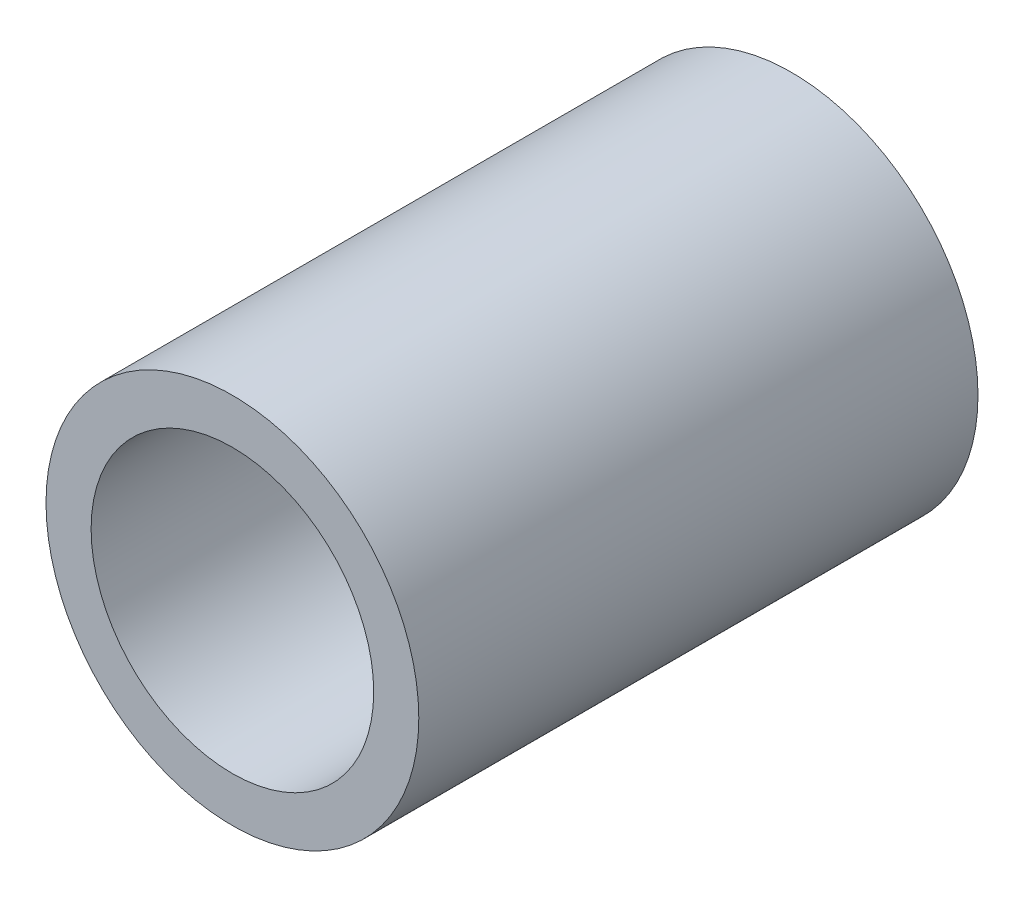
ISO-10303-21;
HEADER;
FILE_DESCRIPTION(('STEP AP214'),'2;1');
FILE_NAME('part.step','',(''),(''),'','','');
FILE_SCHEMA(('AUTOMOTIVE_DESIGN { 1 0 10303 214 1 1 1 1 }'));
ENDSEC;
DATA;
#1=APPLICATION_CONTEXT('core data for automotive mechanical design processes');
#2=APPLICATION_PROTOCOL_DEFINITION('international standard','automotive_design',2000,#1);
#3=PRODUCT_CONTEXT('',#1,'mechanical');
#4=PRODUCT('Part','Part','',(#3));
#5=PRODUCT_RELATED_PRODUCT_CATEGORY('part','',(#4));
#6=PRODUCT_DEFINITION_FORMATION('','',#4);
#7=PRODUCT_DEFINITION_CONTEXT('part definition',#1,'design');
#8=PRODUCT_DEFINITION('design','',#6,#7);
#9=PRODUCT_DEFINITION_SHAPE('','',#8);
#10=(LENGTH_UNIT() NAMED_UNIT(*) SI_UNIT(.MILLI.,.METRE.));
#11=(NAMED_UNIT(*) PLANE_ANGLE_UNIT() SI_UNIT($,.RADIAN.));
#12=(NAMED_UNIT(*) SI_UNIT($,.STERADIAN.) SOLID_ANGLE_UNIT());
#13=UNCERTAINTY_MEASURE_WITH_UNIT(LENGTH_MEASURE(1.E-05),#10,'distance_accuracy_value','');
#14=(GEOMETRIC_REPRESENTATION_CONTEXT(3) GLOBAL_UNCERTAINTY_ASSIGNED_CONTEXT((#13)) GLOBAL_UNIT_ASSIGNED_CONTEXT((#10,
#11,#12)) REPRESENTATION_CONTEXT('',''));
#15=CARTESIAN_POINT('',(0.,0.,0.));
#16=DIRECTION('',(0.,0.,1.));
#17=DIRECTION('',(1.,0.,0.));
#18=AXIS2_PLACEMENT_3D('',#15,#16,#17);
#19=CARTESIAN_POINT('',(0.,0.,9.52500000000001));
#20=DIRECTION('',(0.,0.,1.));
#21=DIRECTION('',(1.,0.,0.));
#22=AXIS2_PLACEMENT_3D('',#19,#20,#21);
#23=PLANE('',#22);
#24=CARTESIAN_POINT('',(0.,0.,9.52500000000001));
#25=DIRECTION('',(0.,0.,1.));
#26=DIRECTION('',(1.,0.,0.));
#27=AXIS2_PLACEMENT_3D('',#24,#25,#26);
#28=CIRCLE('',#27,6.35);
#29=CARTESIAN_POINT('',(-6.3500000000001,0.,9.52499999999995));
#30=VERTEX_POINT('',#29);
#31=EDGE_CURVE('E10',#30,#30,#28,.T.);
#32=ORIENTED_EDGE('',*,*,#31,.T.);
#33=EDGE_LOOP('',(#32));
#34=FACE_BOUND('',#33,.T.);
#35=CARTESIAN_POINT('',(0.,0.,9.52500000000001));
#36=DIRECTION('',(0.,0.,1.));
#37=DIRECTION('',(1.,0.,0.));
#38=AXIS2_PLACEMENT_3D('',#35,#36,#37);
#39=CIRCLE('',#38,4.8133);
#40=CARTESIAN_POINT('',(-4.8133000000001,0.,9.52499999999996));
#41=VERTEX_POINT('',#40);
#42=EDGE_CURVE('E39',#41,#41,#39,.T.);
#43=ORIENTED_EDGE('',*,*,#42,.F.);
#44=EDGE_LOOP('',(#43));
#45=FACE_BOUND('',#44,.T.);
#46=ADVANCED_FACE('F28',(#34,#45),#23,.T.);
#47=CARTESIAN_POINT('',(0.,0.,-9.52500000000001));
#48=DIRECTION('',(0.,0.,1.));
#49=DIRECTION('',(1.,0.,0.));
#50=AXIS2_PLACEMENT_3D('',#47,#48,#49);
#51=PLANE('',#50);
#52=CARTESIAN_POINT('',(0.,0.,-9.52500000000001));
#53=DIRECTION('',(0.,0.,1.));
#54=DIRECTION('',(1.,0.,0.));
#55=AXIS2_PLACEMENT_3D('',#52,#53,#54);
#56=CIRCLE('',#55,6.35);
#57=CARTESIAN_POINT('',(-6.34999999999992,0.,-9.52500000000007));
#58=VERTEX_POINT('',#57);
#59=EDGE_CURVE('E32',#58,#58,#56,.T.);
#60=ORIENTED_EDGE('',*,*,#59,.F.);
#61=EDGE_LOOP('',(#60));
#62=FACE_BOUND('',#61,.T.);
#63=CARTESIAN_POINT('',(0.,0.,-9.52500000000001));
#64=DIRECTION('',(0.,0.,1.));
#65=DIRECTION('',(1.,0.,0.));
#66=AXIS2_PLACEMENT_3D('',#63,#64,#65);
#67=CIRCLE('',#66,4.8133);
#68=CARTESIAN_POINT('',(-4.81329999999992,0.,-9.52500000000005));
#69=VERTEX_POINT('',#68);
#70=EDGE_CURVE('E41',#69,#69,#67,.T.);
#71=ORIENTED_EDGE('',*,*,#70,.T.);
#72=EDGE_LOOP('',(#71));
#73=FACE_BOUND('',#72,.T.);
#74=ADVANCED_FACE('F51',(#62,#73),#51,.F.);
#75=CARTESIAN_POINT('',(0.,0.,9.52500000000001));
#76=DIRECTION('',(0.,0.,-1.));
#77=DIRECTION('',(-1.,0.,0.));
#78=AXIS2_PLACEMENT_3D('',#75,#76,#77);
#79=CYLINDRICAL_SURFACE('',#78,6.35);
#80=CARTESIAN_POINT('',(-6.3500000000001,0.,9.52499999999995));
#81=CARTESIAN_POINT('',(-6.35000000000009,0.,9.32656249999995));
#82=CARTESIAN_POINT('',(-6.35000000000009,0.,9.12812499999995));
#83=CARTESIAN_POINT('',(-6.35000000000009,0.,8.73124999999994));
#84=CARTESIAN_POINT('',(-6.35000000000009,0.,8.53281249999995));
#85=CARTESIAN_POINT('',(-6.35000000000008,0.,8.13593749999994));
#86=CARTESIAN_POINT('',(-6.35000000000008,0.,7.93749999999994));
#87=CARTESIAN_POINT('',(-6.35000000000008,0.,7.54062499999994));
#88=CARTESIAN_POINT('',(-6.35000000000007,0.,7.34218749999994));
#89=CARTESIAN_POINT('',(-6.35000000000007,0.,6.94531249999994));
#90=CARTESIAN_POINT('',(-6.35000000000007,0.,6.74687499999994));
#91=CARTESIAN_POINT('',(-6.35000000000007,0.,6.34999999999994));
#92=CARTESIAN_POINT('',(-6.35000000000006,0.,6.15156249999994));
#93=CARTESIAN_POINT('',(-6.35000000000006,0.,5.75468749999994));
#94=CARTESIAN_POINT('',(-6.35000000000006,0.,5.55624999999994));
#95=CARTESIAN_POINT('',(-6.35000000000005,0.,5.15937499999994));
#96=CARTESIAN_POINT('',(-6.35000000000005,0.,4.96093749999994));
#97=CARTESIAN_POINT('',(-6.35000000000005,0.,4.56406249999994));
#98=CARTESIAN_POINT('',(-6.35000000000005,0.,4.36562499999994));
#99=CARTESIAN_POINT('',(-6.35000000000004,0.,3.96874999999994));
#100=CARTESIAN_POINT('',(-6.35000000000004,0.,3.77031249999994));
#101=CARTESIAN_POINT('',(-6.35000000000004,0.,3.37343749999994));
#102=CARTESIAN_POINT('',(-6.35000000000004,0.,3.17499999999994));
#103=CARTESIAN_POINT('',(-6.35000000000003,0.,2.77812499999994));
#104=CARTESIAN_POINT('',(-6.35000000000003,0.,2.57968749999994));
#105=CARTESIAN_POINT('',(-6.35000000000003,0.,2.18281249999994));
#106=CARTESIAN_POINT('',(-6.35000000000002,0.,1.98437499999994));
#107=CARTESIAN_POINT('',(-6.35000000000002,0.,1.58749999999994));
#108=CARTESIAN_POINT('',(-6.35000000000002,0.,1.38906249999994));
#109=CARTESIAN_POINT('',(-6.35000000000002,0.,0.99218749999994));
#110=CARTESIAN_POINT('',(-6.35000000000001,0.,0.79374999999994));
#111=CARTESIAN_POINT('',(-6.35000000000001,0.,0.396874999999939));
#112=CARTESIAN_POINT('',(-6.35000000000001,0.,0.198437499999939));
#113=CARTESIAN_POINT('',(-6.35,0.,-0.198437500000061));
#114=CARTESIAN_POINT('',(-6.35,0.,-0.396875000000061));
#115=CARTESIAN_POINT('',(-6.35,0.,-0.793750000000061));
#116=CARTESIAN_POINT('',(-6.35,0.,-0.992187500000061));
#117=CARTESIAN_POINT('',(-6.34999999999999,0.,-1.38906250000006));
#118=CARTESIAN_POINT('',(-6.34999999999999,0.,-1.58750000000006));
#119=CARTESIAN_POINT('',(-6.34999999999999,0.,-1.98437500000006));
#120=CARTESIAN_POINT('',(-6.34999999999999,0.,-2.18281250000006));
#121=CARTESIAN_POINT('',(-6.34999999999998,0.,-2.57968750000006));
#122=CARTESIAN_POINT('',(-6.34999999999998,0.,-2.77812500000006));
#123=CARTESIAN_POINT('',(-6.34999999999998,0.,-3.17500000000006));
#124=CARTESIAN_POINT('',(-6.34999999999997,0.,-3.37343750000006));
#125=CARTESIAN_POINT('',(-6.34999999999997,0.,-3.77031250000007));
#126=CARTESIAN_POINT('',(-6.34999999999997,0.,-3.96875000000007));
#127=CARTESIAN_POINT('',(-6.34999999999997,0.,-4.36562500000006));
#128=CARTESIAN_POINT('',(-6.34999999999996,0.,-4.56406250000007));
#129=CARTESIAN_POINT('',(-6.34999999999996,0.,-4.96093750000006));
#130=CARTESIAN_POINT('',(-6.34999999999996,0.,-5.15937500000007));
#131=CARTESIAN_POINT('',(-6.34999999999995,0.,-5.55625000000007));
#132=CARTESIAN_POINT('',(-6.34999999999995,0.,-5.75468750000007));
#133=CARTESIAN_POINT('',(-6.34999999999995,0.,-6.15156250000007));
#134=CARTESIAN_POINT('',(-6.34999999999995,0.,-6.35000000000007));
#135=CARTESIAN_POINT('',(-6.34999999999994,0.,-6.74687500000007));
#136=CARTESIAN_POINT('',(-6.34999999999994,0.,-6.94531250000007));
#137=CARTESIAN_POINT('',(-6.34999999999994,0.,-7.34218750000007));
#138=CARTESIAN_POINT('',(-6.34999999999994,0.,-7.54062500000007));
#139=CARTESIAN_POINT('',(-6.34999999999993,0.,-7.93750000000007));
#140=CARTESIAN_POINT('',(-6.34999999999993,0.,-8.13593750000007));
#141=CARTESIAN_POINT('',(-6.34999999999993,0.,-8.53281250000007));
#142=CARTESIAN_POINT('',(-6.34999999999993,0.,-8.73125000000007));
#143=CARTESIAN_POINT('',(-6.34999999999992,0.,-9.12812500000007));
#144=CARTESIAN_POINT('',(-6.34999999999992,0.,-9.32656250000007));
#145=CARTESIAN_POINT('',(-6.34999999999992,0.,-9.52500000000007));
#146=B_SPLINE_CURVE_WITH_KNOTS('',3,(#80,#81,#82,#83,#84,#85,#86,#87,#88,#89,#90,#91,#92,#93,
#94,#95,#96,#97,#98,#99,#100,#101,#102,#103,#104,#105,#106,#107,#108,#109,#110,#111,#112,#113,
#114,#115,#116,#117,#118,#119,#120,#121,#122,#123,#124,#125,#126,#127,#128,#129,#130,#131,#132,
#133,#134,#135,#136,#137,#138,#139,#140,#141,#142,#143,#144,#145),.UNSPECIFIED.,.F.,.F.,(4,2,2,
2,2,2,2,2,2,2,2,2,2,2,2,2,2,2,2,2,2,2,2,2,2,2,2,2,2,2,2,2,4),(0.,0.595312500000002,1.190625,
1.7859375,2.38125,2.9765625,3.571875,4.1671875,4.7625,5.3578125,5.95312500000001,
6.54843750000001,7.14375000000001,7.73906250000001,8.33437500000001,8.92968750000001,
9.52500000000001,10.1203125,10.715625,11.3109375,11.90625,12.5015625,13.096875,13.6921875,
14.2875,14.8828125,15.478125,16.0734375,16.66875,17.2640625,17.859375,18.4546875,19.05),.UNSPECIFIED.);
#147=EDGE_CURVE('BSEAM30',#30,#58,#146,.T.);
#148=ORIENTED_EDGE('',*,*,#31,.F.);
#149=ORIENTED_EDGE('',*,*,#59,.T.);
#150=ORIENTED_EDGE('',*,*,#147,.T.);
#151=ORIENTED_EDGE('',*,*,#147,.F.);
#152=EDGE_LOOP('',(#148,#150,#149,#151));
#153=FACE_BOUND('',#152,.T.);
#154=ADVANCED_FACE('F30',(#153),#79,.T.);
#155=CARTESIAN_POINT('',(0.,0.,9.52500000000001));
#156=DIRECTION('',(0.,0.,-1.));
#157=DIRECTION('',(-1.,0.,0.));
#158=AXIS2_PLACEMENT_3D('',#155,#156,#157);
#159=CYLINDRICAL_SURFACE('',#158,4.8133);
#160=CARTESIAN_POINT('',(-4.8133000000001,0.,9.52499999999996));
#161=CARTESIAN_POINT('',(-4.8133000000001,0.,9.32656249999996));
#162=CARTESIAN_POINT('',(-4.81330000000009,0.,9.12812499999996));
#163=CARTESIAN_POINT('',(-4.81330000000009,0.,8.73124999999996));
#164=CARTESIAN_POINT('',(-4.81330000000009,0.,8.53281249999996));
#165=CARTESIAN_POINT('',(-4.81330000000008,0.,8.13593749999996));
#166=CARTESIAN_POINT('',(-4.81330000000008,0.,7.93749999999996));
#167=CARTESIAN_POINT('',(-4.81330000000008,0.,7.54062499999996));
#168=CARTESIAN_POINT('',(-4.81330000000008,0.,7.34218749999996));
#169=CARTESIAN_POINT('',(-4.81330000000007,0.,6.94531249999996));
#170=CARTESIAN_POINT('',(-4.81330000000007,0.,6.74687499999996));
#171=CARTESIAN_POINT('',(-4.81330000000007,0.,6.34999999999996));
#172=CARTESIAN_POINT('',(-4.81330000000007,0.,6.15156249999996));
#173=CARTESIAN_POINT('',(-4.81330000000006,0.,5.75468749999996));
#174=CARTESIAN_POINT('',(-4.81330000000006,0.,5.55624999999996));
#175=CARTESIAN_POINT('',(-4.81330000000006,0.,5.15937499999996));
#176=CARTESIAN_POINT('',(-4.81330000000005,0.,4.96093749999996));
#177=CARTESIAN_POINT('',(-4.81330000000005,0.,4.56406249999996));
#178=CARTESIAN_POINT('',(-4.81330000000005,0.,4.36562499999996));
#179=CARTESIAN_POINT('',(-4.81330000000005,0.,3.96874999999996));
#180=CARTESIAN_POINT('',(-4.81330000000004,0.,3.77031249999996));
#181=CARTESIAN_POINT('',(-4.81330000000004,0.,3.37343749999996));
#182=CARTESIAN_POINT('',(-4.81330000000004,0.,3.17499999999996));
#183=CARTESIAN_POINT('',(-4.81330000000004,0.,2.77812499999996));
#184=CARTESIAN_POINT('',(-4.81330000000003,0.,2.57968749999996));
#185=CARTESIAN_POINT('',(-4.81330000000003,0.,2.18281249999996));
#186=CARTESIAN_POINT('',(-4.81330000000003,0.,1.98437499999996));
#187=CARTESIAN_POINT('',(-4.81330000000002,0.,1.58749999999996));
#188=CARTESIAN_POINT('',(-4.81330000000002,0.,1.38906249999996));
#189=CARTESIAN_POINT('',(-4.81330000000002,0.,0.992187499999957));
#190=CARTESIAN_POINT('',(-4.81330000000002,0.,0.793749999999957));
#191=CARTESIAN_POINT('',(-4.81330000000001,0.,0.396874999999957));
#192=CARTESIAN_POINT('',(-4.81330000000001,0.,0.198437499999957));
#193=CARTESIAN_POINT('',(-4.81330000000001,0.,-0.198437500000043));
#194=CARTESIAN_POINT('',(-4.8133,0.,-0.396875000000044));
#195=CARTESIAN_POINT('',(-4.8133,0.,-0.793750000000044));
#196=CARTESIAN_POINT('',(-4.8133,0.,-0.992187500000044));
#197=CARTESIAN_POINT('',(-4.8133,0.,-1.38906250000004));
#198=CARTESIAN_POINT('',(-4.81329999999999,0.,-1.58750000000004));
#199=CARTESIAN_POINT('',(-4.81329999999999,0.,-1.98437500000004));
#200=CARTESIAN_POINT('',(-4.81329999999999,0.,-2.18281250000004));
#201=CARTESIAN_POINT('',(-4.81329999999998,0.,-2.57968750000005));
#202=CARTESIAN_POINT('',(-4.81329999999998,0.,-2.77812500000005));
#203=CARTESIAN_POINT('',(-4.81329999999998,0.,-3.17500000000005));
#204=CARTESIAN_POINT('',(-4.81329999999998,0.,-3.37343750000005));
#205=CARTESIAN_POINT('',(-4.81329999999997,0.,-3.77031250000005));
#206=CARTESIAN_POINT('',(-4.81329999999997,0.,-3.96875000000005));
#207=CARTESIAN_POINT('',(-4.81329999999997,0.,-4.36562500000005));
#208=CARTESIAN_POINT('',(-4.81329999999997,0.,-4.56406250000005));
#209=CARTESIAN_POINT('',(-4.81329999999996,0.,-4.96093750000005));
#210=CARTESIAN_POINT('',(-4.81329999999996,0.,-5.15937500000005));
#211=CARTESIAN_POINT('',(-4.81329999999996,0.,-5.55625000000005));
#212=CARTESIAN_POINT('',(-4.81329999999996,0.,-5.75468750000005));
#213=CARTESIAN_POINT('',(-4.81329999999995,0.,-6.15156250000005));
#214=CARTESIAN_POINT('',(-4.81329999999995,0.,-6.35000000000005));
#215=CARTESIAN_POINT('',(-4.81329999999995,0.,-6.74687500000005));
#216=CARTESIAN_POINT('',(-4.81329999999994,0.,-6.94531250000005));
#217=CARTESIAN_POINT('',(-4.81329999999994,0.,-7.34218750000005));
#218=CARTESIAN_POINT('',(-4.81329999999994,0.,-7.54062500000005));
#219=CARTESIAN_POINT('',(-4.81329999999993,0.,-7.93750000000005));
#220=CARTESIAN_POINT('',(-4.81329999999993,0.,-8.13593750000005));
#221=CARTESIAN_POINT('',(-4.81329999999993,0.,-8.53281250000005));
#222=CARTESIAN_POINT('',(-4.81329999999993,0.,-8.73125000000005));
#223=CARTESIAN_POINT('',(-4.81329999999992,0.,-9.12812500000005));
#224=CARTESIAN_POINT('',(-4.81329999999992,0.,-9.32656250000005));
#225=CARTESIAN_POINT('',(-4.81329999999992,0.,-9.52500000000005));
#226=B_SPLINE_CURVE_WITH_KNOTS('',3,(#160,#161,#162,#163,#164,#165,#166,#167,#168,#169,#170,
#171,#172,#173,#174,#175,#176,#177,#178,#179,#180,#181,#182,#183,#184,#185,#186,#187,#188,#189,
#190,#191,#192,#193,#194,#195,#196,#197,#198,#199,#200,#201,#202,#203,#204,#205,#206,#207,#208,
#209,#210,#211,#212,#213,#214,#215,#216,#217,#218,#219,#220,#221,#222,#223,#224,#225),
.UNSPECIFIED.,.F.,.F.,(4,2,2,2,2,2,2,2,2,2,2,2,2,2,2,2,2,2,2,2,2,2,2,2,2,2,2,2,2,2,2,2,4),(0.,
0.595312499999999,1.190625,1.7859375,2.38125,2.9765625,3.571875,4.1671875,4.7625,5.3578125,
5.953125,6.5484375,7.14375,7.7390625,8.334375,8.9296875,9.525,10.1203125,10.715625,11.3109375,
11.90625,12.5015625,13.096875,13.6921875,14.2875,14.8828125,15.478125,16.0734375,16.66875,
17.2640625,17.859375,18.4546875,19.05),.UNSPECIFIED.);
#227=EDGE_CURVE('BSEAM47',#41,#69,#226,.T.);
#228=ORIENTED_EDGE('',*,*,#42,.T.);
#229=ORIENTED_EDGE('',*,*,#70,.F.);
#230=ORIENTED_EDGE('',*,*,#227,.T.);
#231=ORIENTED_EDGE('',*,*,#227,.F.);
#232=EDGE_LOOP('',(#228,#230,#229,#231));
#233=FACE_BOUND('',#232,.T.);
#234=ADVANCED_FACE('F47',(#233),#159,.F.);
#235=CLOSED_SHELL('',(#46,#74,#154,#234));
#236=MANIFOLD_SOLID_BREP('B2',#235);
#237=ADVANCED_BREP_SHAPE_REPRESENTATION('',(#18,#236),#14);
#238=SHAPE_DEFINITION_REPRESENTATION(#9,#237);
ENDSEC;
END-ISO-10303-21;
